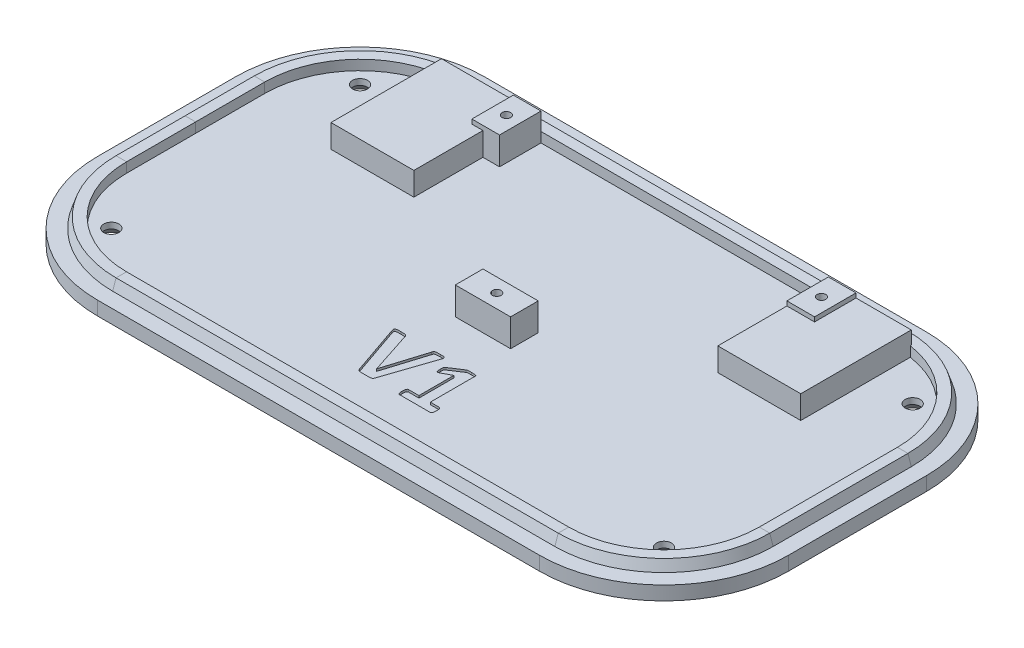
from build123d import *

# Parameters (mm, degrees)
SKETCH1_W                                      = 158.75
SKETCH1_H                                      = 88.9
BOSS_EXTRUDE1_DEPTH                            = 3.175
FILLET1_R                                      = 28.575
SKETCH4_R                                      = 1.5875
CUT_EXTRUDE1_DEPTH                             = 92.028972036
SKETCH5_W                                      = 19.05
SKETCH5_H                                      = 25.4
BOSS_EXTRUDE2_DEPTH                            = 8.509
CUT_EXTRUDE2_DEPTH                             = 3.175
CUT_EXTRUDE3_DEPTH                             = 3.81
SKETCH8_W                                      = 12.7
SKETCH8_H                                      = 6.35
BOSS_EXTRUDE3_DEPTH                            = 6.35
BOSS_EXTRUDE4_REACH                            = 93.471
SKETCH10_W                                     = 6.35
SKETCH10_H                                     = 9.525
SKETCH11_R                                     = 0.9906
CUT_EXTRUDE4_DEPTH                             = 6.35
CSK_FOR_4_FLAT_HEAD_MACHINE_SCREW1_D           = 3.4544
CSK_FOR_4_FLAT_HEAD_MACHINE_SCREW1_CSINK_D     = 6.5981834
CSK_FOR_4_FLAT_HEAD_MACHINE_SCREW1_CSINK_ANGLE = 82
CUT_EXTRUDE5_DEPTH                             = 0.508


with BuildPart() as part:
    # Sketch1 → Boss-Extrude1 (new body)
    with BuildSketch(Plane(origin=(0, 0, 0), x_dir=(1, 0, 0), z_dir=(0, 1, 0))):
        Rectangle(SKETCH1_W, SKETCH1_H)
    extrude(amount=BOSS_EXTRUDE1_DEPTH)

    # Fillet1
    fillet1_edges = [part.edges().sort_by_distance(p)[0] for p in [
        (-79.375, 1.5875, -44.45),
        (79.375, 1.5875, -44.45),
        (79.375, 1.5875, 44.45),
        (-79.375, 1.5875, 44.45),
    ]]
    fillet(fillet1_edges, radius=FILLET1_R)

    # Sweep1: sweep along a path in Sketch2
    with BuildLine(Plane(origin=(0, 3.175, 0), x_dir=(1, 0, 0), z_dir=(0, 1, 0))) as sweep1_path:
        Line((50.8, 40.95), (-50.8, 40.95))
        ThreePointArc((-50.8, 40.95), (-68.530702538, 33.605702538), (-75.875, 15.875))
        Line((-75.875, 15.875), (-75.875, -15.875))
        ThreePointArc((-75.875, -15.875), (-68.530702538, -33.605702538), (-50.8, -40.95))
        Line((-50.8, -40.95), (50.8, -40.95))
        ThreePointArc((50.8, -40.95), (68.530702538, -33.605702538), (75.875, -15.875))
        Line((75.875, -15.875), (75.875, 15.875))
        ThreePointArc((75.875, 15.875), (68.530702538, 33.605702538), (50.8, 40.95))
    # Sketch3 → Sweep1 (sweep)
    with BuildSketch(Plane.XY):
        Polygon((-75.875, 3.175), (-75.112997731, 5.461), (-72.7, 5.461), (-72.7, 3.175), align=None)
    sweep(path=sweep1_path.line)

    # Sketch4 → Cut-Extrude1 (cut, through all)
    with BuildSketch(Plane(origin=(0, 3.175, 0), x_dir=(1, 0, 0), z_dir=(0, 1, 0))):
        with Locations(Location((-63.5, 28.575, 0), (0, 0, 270))):
            Circle(SKETCH4_R)
        with Locations(Location((63.5, 28.575, 0), (0, 0, 270))):
            Circle(SKETCH4_R)
        with Locations(Location((-63.5, -28.575, 0), (0, 0, 270))):
            Circle(SKETCH4_R)
        with Locations(Location((63.5, -28.575, 0), (0, 0, 270))):
            Circle(SKETCH4_R)
    extrude(amount=-CUT_EXTRUDE1_DEPTH, mode=Mode.SUBTRACT)

    # Sketch5 → Boss-Extrude2 (add)
    with BuildSketch(Plane.XZ):
        with Locations((-44.45, -25.075)):
            Rectangle(SKETCH5_W, SKETCH5_H)
        with Locations((44.45, -25.075)):
            Rectangle(SKETCH5_W, SKETCH5_H)
    extrude(amount=-BOSS_EXTRUDE2_DEPTH)

    # Sketch6 → Cut-Extrude2 (cut)
    with BuildSketch(Plane.XZ):
        with BuildLine():
            Line((-42.2275, -29.52), (-42.2275, -25.198029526))
            ThreePointArc((-42.2275, -25.198029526), (-44.45, -15.55), (-46.6725, -25.198029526))
            Line((-46.6725, -25.198029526), (-46.6725, -29.52))
            ThreePointArc((-46.6725, -29.52), (-44.45, -31.7425), (-42.2275, -29.52))
        make_face()
        with BuildLine():
            Line((42.2275, -29.52), (42.2275, -25.198029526))
            ThreePointArc((42.2275, -25.198029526), (44.45, -15.55), (46.6725, -25.198029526))
            Line((46.6725, -25.198029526), (46.6725, -29.52))
            ThreePointArc((46.6725, -29.52), (44.45, -31.7425), (42.2275, -29.52))
        make_face()
    extrude(amount=-CUT_EXTRUDE2_DEPTH, mode=Mode.SUBTRACT)

    # Sketch7 → Cut-Extrude3 (cut)
    with BuildSketch(Plane.XZ.offset(-3.175)):
        with BuildLine():
            Line((49.53, -20.63), (49.53, -29.52))
            ThreePointArc((49.53, -29.52), (44.45, -34.6), (39.37, -29.52))
            Line((39.37, -29.52), (39.37, -20.63))
            ThreePointArc((39.37, -20.63), (44.45, -15.55), (49.53, -20.63))
        make_face()
        with BuildLine():
            Line((-49.53, -20.63), (-49.53, -29.52))
            ThreePointArc((-49.53, -29.52), (-44.45, -34.6), (-39.37, -29.52))
            Line((-39.37, -29.52), (-39.37, -20.63))
            ThreePointArc((-39.37, -20.63), (-44.45, -15.55), (-49.53, -20.63))
        make_face()
    extrude(amount=-CUT_EXTRUDE3_DEPTH, mode=Mode.SUBTRACT)

    # Sketch8 → Boss-Extrude3 (add)
    with BuildSketch(Plane(origin=(0, 3.175, 0), x_dir=(1, 0, 0), z_dir=(0, 1, 0))):
        with Locations((0, -3.5)):
            Rectangle(SKETCH8_W, SKETCH8_H)
    extrude(amount=BOSS_EXTRUDE3_DEPTH)

    # Sketch10 → Boss-Extrude4 (add, up to next)
    with BuildSketch(Plane(origin=(0, 9.525, 0), x_dir=(1, 0, 0), z_dir=(0, 1, 0)), mode=Mode.PRIVATE) as boss_extrude4_sk1:
        with Locations((-34.29, 33.0125)):
            Rectangle(SKETCH10_W, SKETCH10_H)
    boss_extrude4_tool1 = extrude(boss_extrude4_sk1.sketch, amount=-BOSS_EXTRUDE4_REACH, mode=Mode.PRIVATE) - part.part
    # Sketch10 → Boss-Extrude4 (add, up to next)
    with BuildSketch(Plane(origin=(0, 9.525, 0), x_dir=(1, 0, 0), z_dir=(0, 1, 0)), mode=Mode.PRIVATE) as boss_extrude4_sk2:
        with Locations((38.1, 33.0125)):
            Rectangle(SKETCH10_W, SKETCH10_H)
    boss_extrude4_tool2 = extrude(boss_extrude4_sk2.sketch, amount=-BOSS_EXTRUDE4_REACH, mode=Mode.PRIVATE) - part.part
    add(boss_extrude4_tool1.solids().sort_by_distance((-34.29, 9.525, -33.0125))[0])
    add(boss_extrude4_tool2.solids().sort_by_distance((38.1, 9.525, -33.0125))[0])

    # Sketch11 → Cut-Extrude4 (cut)
    with BuildSketch(Plane(origin=(0, 9.525, 0), x_dir=(1, 0, 0), z_dir=(0, 1, 0))):
        with Locations(Location((-34.29, 33.0125, 0), (0, 0, 270))):
            Circle(SKETCH11_R)
        with Locations(Location((0, -3.5, 0), (0, 0, 270))):
            Circle(SKETCH11_R)
        with Locations(Location((38.1, 33.0125, 0), (0, 0, 270))):
            Circle(SKETCH11_R)
    extrude(amount=-CUT_EXTRUDE4_DEPTH, mode=Mode.SUBTRACT)

    # CSK for _4 Flat Head Machine Screw1 (through all)
    with Locations(Plane(origin=(0, 0, 0), x_dir=(-1, 0, 0), z_dir=(0, -1, 0))):
        with Locations((-63.5, 28.575), (-63.5, -28.575), (63.5, -28.575), (63.5, 28.575)):
            CounterSinkHole(CSK_FOR_4_FLAT_HEAD_MACHINE_SCREW1_D / 2, CSK_FOR_4_FLAT_HEAD_MACHINE_SCREW1_CSINK_D / 2, counter_sink_angle=CSK_FOR_4_FLAT_HEAD_MACHINE_SCREW1_CSINK_ANGLE)

    # Sketch14 → Cut-Extrude5 (cut)
    with BuildSketch(Plane(origin=(0, 3.175, 0), x_dir=(1, 0, 0), z_dir=(0, 1, 0))):
        with BuildLine():
            add(Edge.make_bspline(
                [(-3.414292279, -28.070151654), (-3.430772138, -28.120578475), (-3.461535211, -28.214710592), (-3.537016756, -28.33968519), (-3.649199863, -28.439772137), (-3.813075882, -28.50336724), (-4.029965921, -28.544677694), (-4.248633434, -28.560089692), (-4.458992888, -28.56636337), (-4.646702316, -28.573023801), (-4.858793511, -28.575590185), (-5.007628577, -28.575204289), (-5.086420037, -28.575)],
                knots=[0, 0, 0, 0, 0.838483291, 1.565202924, 2.285525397, 3.175638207, 4.308717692, 5.77750847, 6.640818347, 7.642709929, 8.752079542, 10, 10, 10, 10], degree=3))
            add(Edge.make_bspline(
                [(-5.086420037, -28.575), (-5.208983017, -28.57517596), (-5.435631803, -28.575501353), (-5.749893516, -28.573449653), (-6.014652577, -28.565814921), (-6.235068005, -28.549864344), (-6.415020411, -28.52272174), (-6.562122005, -28.493613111), (-6.679092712, -28.447810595), (-6.775535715, -28.39633883), (-6.850846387, -28.330091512), (-6.909921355, -28.249565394), (-6.951129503, -28.15035791), (-6.975882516, -28.079020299), (-6.989085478, -28.040969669)],
                knots=[0, 0, 0, 0, 2.065956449, 3.8204564, 5.296959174, 6.530624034, 7.541636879, 8.365060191, 9.0501898, 9.652188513, 10.19821837, 10.726225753, 11.320584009, 12, 12, 12, 12], degree=3))
            Line((-6.989085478, -28.040969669), (-10.832352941, -16.88761489))
            add(Edge.make_bspline(
                [(-10.832352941, -16.88761489), (-10.849904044, -16.832192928), (-10.883064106, -16.7274818), (-10.928844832, -16.580577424), (-10.956506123, -16.450188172), (-10.980192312, -16.33914598), (-10.985756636, -16.240696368), (-10.966644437, -16.156548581), (-10.935177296, -16.082276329), (-10.879188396, -16.022129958), (-10.802870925, -15.974344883), (-10.70468801, -15.941621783), (-10.587320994, -15.915579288), (-10.447498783, -15.899144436), (-10.2828792, -15.888641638), (-10.089291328, -15.878889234), (-9.866417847, -15.878274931), (-9.707869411, -15.876131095), (-9.62421875, -15.875)],
                knots=[0, 0, 0, 0, 1.275097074, 2.409096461, 3.37162946, 4.195875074, 4.900146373, 5.510995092, 6.074169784, 6.648148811, 7.281310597, 8.030356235, 8.9049585, 9.915687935, 11.113310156, 12.522660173, 14.165344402, 16, 16, 16, 16], degree=3))
            add(Edge.make_bspline(
                [(-9.62421875, -15.875), (-9.552225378, -15.874357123), (-9.416964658, -15.873149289), (-9.226381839, -15.881046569), (-9.060879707, -15.885286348), (-8.881704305, -15.896830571), (-8.700779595, -15.914245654), (-8.526165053, -15.953625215), (-8.395421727, -16.011260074), (-8.317073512, -16.109241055), (-8.261972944, -16.222082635), (-8.23321018, -16.305519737), (-8.217647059, -16.35066636)],
                knots=[0, 0, 0, 0, 1.327706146, 2.494486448, 3.517808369, 4.380703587, 5.807288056, 6.860376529, 7.686876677, 8.373845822, 9.120111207, 10, 10, 10, 10], degree=3))
            Line((-8.217647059, -16.35066636), (-5.051401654, -26.056594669))
            Line((-5.051401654, -26.056594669), (-5.042647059, -26.056594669))
            Line((-5.042647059, -26.056594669), (-2.054411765, -16.400275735))
            add(Edge.make_bspline(
                [(-2.054411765, -16.400275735), (-2.039743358, -16.349520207), (-2.013248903, -16.257844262), (-1.96300418, -16.129616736), (-1.872805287, -16.031359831), (-1.739662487, -15.959570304), (-1.556249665, -15.912879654), (-1.36605541, -15.896801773), (-1.180035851, -15.88536512), (-1.006771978, -15.880997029), (-0.809371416, -15.873195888), (-0.669250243, -15.874376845), (-0.5953125, -15.875)],
                knots=[0, 0, 0, 0, 0.926230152, 1.672980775, 2.38414643, 3.207679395, 4.285745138, 5.673211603, 6.542959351, 7.547978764, 8.706141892, 10, 10, 10, 10], degree=3))
            add(Edge.make_bspline(
                [(-0.5953125, -15.875), (-0.523345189, -15.876279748), (-0.38718931, -15.878700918), (-0.19621347, -15.877474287), (-0.03113831, -15.892757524), (0.110572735, -15.901195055), (0.230144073, -15.920910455), (0.329754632, -15.949845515), (0.410540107, -15.988709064), (0.487000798, -16.061490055), (0.544316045, -16.190748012), (0.526985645, -16.384302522), (0.46999925, -16.625400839), (0.408586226, -16.803473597), (0.373529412, -16.905124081)],
                knots=[0, 0, 0, 0, 1.300449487, 2.460337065, 3.446878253, 4.293259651, 5.024138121, 5.630054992, 6.164487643, 6.624391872, 7.51295335, 8.602561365, 10.06061698, 12, 12, 12, 12], degree=3))
            Line((0.373529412, -16.905124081), (-3.414292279, -28.070151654))
        make_face()
        with BuildLine():
            add(Edge.make_bspline(
                [(10.178676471, -27.56238511), (10.17846668, -27.650029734), (10.178081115, -27.811107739), (10.15335402, -28.031337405), (10.122000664, -28.211573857), (10.072524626, -28.35113238), (10.014299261, -28.455646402), (9.945669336, -28.526169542), (9.866946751, -28.569698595), (9.810542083, -28.573210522), (9.781801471, -28.575)],
                knots=[0, 0, 0, 0, 1.769380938, 3.251863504, 4.473793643, 5.456147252, 6.231459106, 6.87077347, 7.424610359, 8, 8, 8, 8], degree=3))
            Line((9.781801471, -28.575), (2.719761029, -28.575))
            add(Edge.make_bspline(
                [(2.719761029, -28.575), (2.694066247, -28.572768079), (2.64084806, -28.568145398), (2.564772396, -28.527000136), (2.499239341, -28.454417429), (2.440438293, -28.351372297), (2.39150977, -28.211468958), (2.358904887, -28.031551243), (2.339954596, -27.810832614), (2.336461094, -27.649974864), (2.334558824, -27.56238511)],
                knots=[0, 0, 0, 0, 0.521835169, 1.080807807, 1.712179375, 2.494680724, 3.486143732, 4.719404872, 6.213660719, 8, 8, 8, 8], degree=3))
            add(Edge.make_bspline(
                [(2.334558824, -27.56238511), (2.335699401, -27.472899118), (2.337784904, -27.309277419), (2.351696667, -27.085125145), (2.387224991, -26.904361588), (2.431985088, -26.760826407), (2.490600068, -26.652575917), (2.558025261, -26.57462049), (2.639411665, -26.529557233), (2.696901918, -26.523574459), (2.725597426, -26.520588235)],
                knots=[0, 0, 0, 0, 1.773338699, 3.242481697, 4.440534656, 5.415572, 6.2091949, 6.863837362, 7.432899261, 8, 8, 8, 8], degree=3))
            Line((2.725597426, -26.520588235), (5.136029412, -26.520588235))
            Line((5.136029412, -26.520588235), (5.136029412, -18.489705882))
            Line((5.136029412, -18.489705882), (3.07578125, -19.610294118))
            add(Edge.make_bspline(
                [(3.07578125, -19.610294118), (3.007271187, -19.64077472), (2.886994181, -19.694286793), (2.720809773, -19.749290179), (2.579516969, -19.753765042), (2.462693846, -19.689526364), (2.395220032, -19.555882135), (2.354690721, -19.368785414), (2.34046723, -19.109420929), (2.336705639, -18.911813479), (2.334558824, -18.799034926)],
                knots=[0, 0, 0, 0, 1.16110972, 2.038456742, 2.701448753, 3.288176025, 3.990880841, 4.937165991, 6.251978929, 8, 8, 8, 8], degree=3))
            add(Edge.make_bspline(
                [(2.334558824, -18.799034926), (2.335440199, -18.726077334), (2.337027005, -18.59472644), (2.3404252, -18.414427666), (2.355918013, -18.266065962), (2.388940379, -18.142365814), (2.433335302, -18.038503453), (2.500878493, -17.953902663), (2.58774804, -17.87906585), (2.654107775, -17.832461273), (2.690579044, -17.806847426)],
                knots=[0, 0, 0, 0, 1.56313437, 2.814225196, 3.86369772, 4.748352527, 5.550351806, 6.263187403, 7.045448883, 8, 8, 8, 8], degree=3))
            Line((2.690579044, -17.806847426), (5.439522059, -16.006318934))
            add(Edge.make_bspline(
                [(5.439522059, -16.006318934), (5.457410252, -15.992563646), (5.495214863, -15.963493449), (5.570176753, -15.940231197), (5.658106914, -15.915238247), (5.770924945, -15.899406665), (5.911819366, -15.88317197), (6.092288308, -15.881401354), (6.31879567, -15.872728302), (6.487136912, -15.874189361), (6.580537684, -15.875)],
                knots=[0, 0, 0, 0, 0.462162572, 0.976726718, 1.600024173, 2.352504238, 3.321320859, 4.526493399, 6.072794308, 8, 8, 8, 8], degree=3))
            add(Edge.make_bspline(
                [(6.580537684, -15.875), (6.695353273, -15.875105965), (6.899767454, -15.875294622), (7.173176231, -15.88658852), (7.382568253, -15.904241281), (7.53543173, -15.933712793), (7.64609897, -15.965802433), (7.71221836, -16.02494963), (7.748514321, -16.095990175), (7.749962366, -16.147878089), (7.750735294, -16.175574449)],
                knots=[0, 0, 0, 0, 2.095956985, 3.731578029, 4.998773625, 5.921870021, 6.585026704, 7.062945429, 7.499825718, 8, 8, 8, 8], degree=3))
            Line((7.750735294, -16.175574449), (7.750735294, -26.520588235))
            Line((7.750735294, -26.520588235), (9.790556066, -26.520588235))
            add(Edge.make_bspline(
                [(9.790556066, -26.520588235), (9.819252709, -26.523574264), (9.876745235, -26.529556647), (9.958113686, -26.574622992), (10.025622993, -26.652563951), (10.083816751, -26.76088689), (10.130619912, -26.903722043), (10.155222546, -27.086094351), (10.177581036, -27.308928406), (10.178289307, -27.472805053), (10.178676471, -27.56238511)],
                knots=[0, 0, 0, 0, 0.567469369, 1.136901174, 1.79196917, 2.586107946, 3.56177909, 4.753767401, 6.225508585, 8, 8, 8, 8], degree=3))
        make_face()
    extrude(amount=-CUT_EXTRUDE5_DEPTH, mode=Mode.SUBTRACT)


solid = part.part
